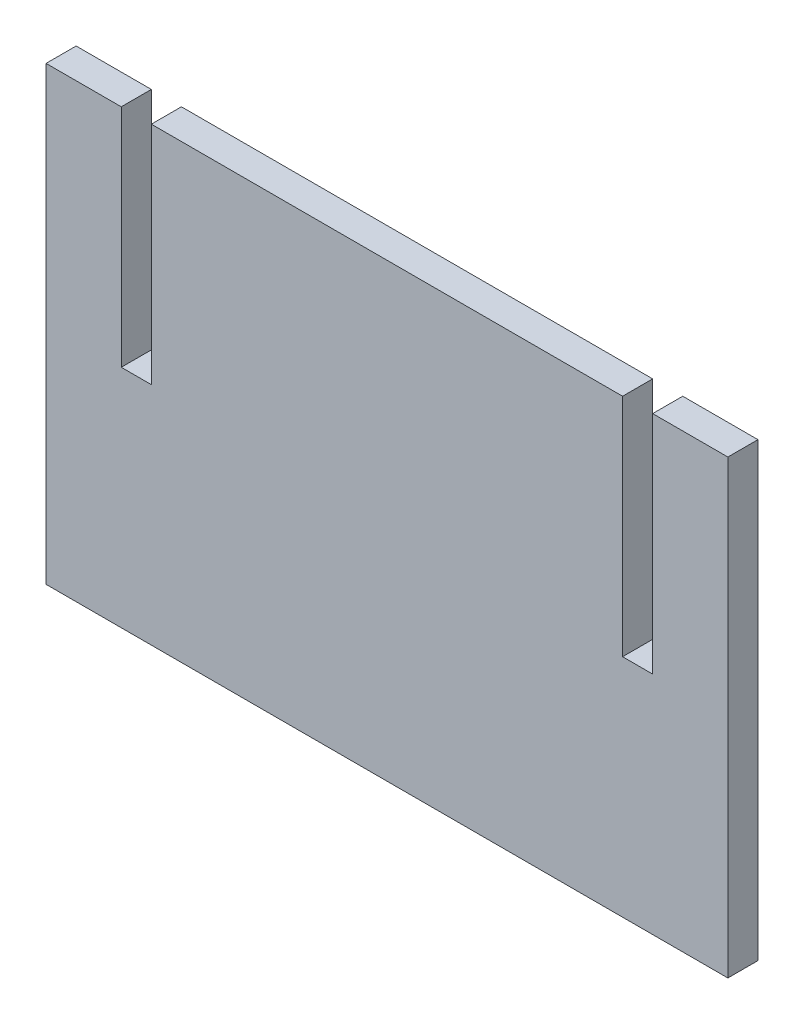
ISO-10303-21;
HEADER;
FILE_DESCRIPTION(('STEP AP214'),'2;1');
FILE_NAME('part.step','',(''),(''),'','','');
FILE_SCHEMA(('AUTOMOTIVE_DESIGN { 1 0 10303 214 1 1 1 1 }'));
ENDSEC;
DATA;
#1=APPLICATION_CONTEXT('core data for automotive mechanical design processes');
#2=APPLICATION_PROTOCOL_DEFINITION('international standard','automotive_design',2000,#1);
#3=PRODUCT_CONTEXT('',#1,'mechanical');
#4=PRODUCT('Part','Part','',(#3));
#5=PRODUCT_RELATED_PRODUCT_CATEGORY('part','',(#4));
#6=PRODUCT_DEFINITION_FORMATION('','',#4);
#7=PRODUCT_DEFINITION_CONTEXT('part definition',#1,'design');
#8=PRODUCT_DEFINITION('design','',#6,#7);
#9=PRODUCT_DEFINITION_SHAPE('','',#8);
#10=(LENGTH_UNIT() NAMED_UNIT(*) SI_UNIT(.MILLI.,.METRE.));
#11=(NAMED_UNIT(*) PLANE_ANGLE_UNIT() SI_UNIT($,.RADIAN.));
#12=(NAMED_UNIT(*) SI_UNIT($,.STERADIAN.) SOLID_ANGLE_UNIT());
#13=UNCERTAINTY_MEASURE_WITH_UNIT(LENGTH_MEASURE(1.E-05),#10,'distance_accuracy_value','');
#14=(GEOMETRIC_REPRESENTATION_CONTEXT(3) GLOBAL_UNCERTAINTY_ASSIGNED_CONTEXT((#13)) GLOBAL_UNIT_ASSIGNED_CONTEXT((#10,
#11,#12)) REPRESENTATION_CONTEXT('',''));
#15=CARTESIAN_POINT('',(0.,0.,0.));
#16=DIRECTION('',(0.,0.,1.));
#17=DIRECTION('',(1.,0.,0.));
#18=AXIS2_PLACEMENT_3D('',#15,#16,#17);
#19=CARTESIAN_POINT('',(0.,90.,12.));
#20=DIRECTION('',(0.,1.,0.));
#21=DIRECTION('',(-1.,0.,0.));
#22=AXIS2_PLACEMENT_3D('',#19,#20,#21);
#23=PLANE('',#22);
#24=DIRECTION('',(1.,0.,0.));
#25=VECTOR('',#24,1.);
#26=CARTESIAN_POINT('',(0.,90.,0.));
#27=LINE('',#26,#25);
#28=CARTESIAN_POINT('',(-94.,90.,0.));
#29=VERTEX_POINT('',#28);
#30=CARTESIAN_POINT('',(94.,90.,0.));
#31=VERTEX_POINT('',#30);
#32=EDGE_CURVE('E163',#29,#31,#27,.T.);
#33=ORIENTED_EDGE('',*,*,#32,.F.);
#34=DIRECTION('',(0.,0.,-1.));
#35=VECTOR('',#34,1.);
#36=CARTESIAN_POINT('',(-94.,90.,12.));
#37=LINE('',#36,#35);
#38=CARTESIAN_POINT('',(-94.,90.,12.));
#39=VERTEX_POINT('',#38);
#40=EDGE_CURVE('E11',#39,#29,#37,.T.);
#41=ORIENTED_EDGE('',*,*,#40,.F.);
#42=DIRECTION('',(1.,0.,0.));
#43=VECTOR('',#42,1.);
#44=CARTESIAN_POINT('',(0.,90.,12.));
#45=LINE('',#44,#43);
#46=CARTESIAN_POINT('',(94.,90.,12.));
#47=VERTEX_POINT('',#46);
#48=EDGE_CURVE('E190',#39,#47,#45,.T.);
#49=ORIENTED_EDGE('',*,*,#48,.T.);
#50=DIRECTION('',(0.,0.,-1.));
#51=VECTOR('',#50,1.);
#52=CARTESIAN_POINT('',(94.,90.,12.));
#53=LINE('',#52,#51);
#54=EDGE_CURVE('E62',#47,#31,#53,.T.);
#55=ORIENTED_EDGE('',*,*,#54,.T.);
#56=EDGE_LOOP('',(#33,#41,#49,#55));
#57=FACE_BOUND('',#56,.T.);
#58=ADVANCED_FACE('F45',(#57),#23,.T.);
#59=CARTESIAN_POINT('',(-94.,0.,12.));
#60=DIRECTION('',(1.,0.,0.));
#61=DIRECTION('',(0.,1.,0.));
#62=AXIS2_PLACEMENT_3D('',#59,#60,#61);
#63=PLANE('',#62);
#64=DIRECTION('',(0.,-1.,0.));
#65=VECTOR('',#64,1.);
#66=CARTESIAN_POINT('',(-94.,0.,0.));
#67=LINE('',#66,#65);
#68=CARTESIAN_POINT('',(-94.,0.,0.));
#69=VERTEX_POINT('',#68);
#70=EDGE_CURVE('E165',#29,#69,#67,.T.);
#71=ORIENTED_EDGE('',*,*,#70,.T.);
#72=DIRECTION('',(0.,0.,-1.));
#73=VECTOR('',#72,1.);
#74=CARTESIAN_POINT('',(-94.,0.,12.));
#75=LINE('',#74,#73);
#76=CARTESIAN_POINT('',(-94.,0.,12.));
#77=VERTEX_POINT('',#76);
#78=EDGE_CURVE('E54',#77,#69,#75,.T.);
#79=ORIENTED_EDGE('',*,*,#78,.F.);
#80=DIRECTION('',(0.,-1.,0.));
#81=VECTOR('',#80,1.);
#82=CARTESIAN_POINT('',(-94.,0.,12.));
#83=LINE('',#82,#81);
#84=EDGE_CURVE('E227',#39,#77,#83,.T.);
#85=ORIENTED_EDGE('',*,*,#84,.F.);
#86=ORIENTED_EDGE('',*,*,#40,.T.);
#87=EDGE_LOOP('',(#71,#79,#85,#86));
#88=FACE_BOUND('',#87,.T.);
#89=ADVANCED_FACE('F47',(#88),#63,.F.);
#90=CARTESIAN_POINT('',(0.,0.,12.));
#91=DIRECTION('',(0.,1.,0.));
#92=DIRECTION('',(-1.,0.,0.));
#93=AXIS2_PLACEMENT_3D('',#90,#91,#92);
#94=PLANE('',#93);
#95=DIRECTION('',(1.,0.,0.));
#96=VECTOR('',#95,1.);
#97=CARTESIAN_POINT('',(0.,0.,0.));
#98=LINE('',#97,#96);
#99=CARTESIAN_POINT('',(-106.,0.,0.));
#100=VERTEX_POINT('',#99);
#101=EDGE_CURVE('E170',#100,#69,#98,.T.);
#102=ORIENTED_EDGE('',*,*,#101,.F.);
#103=DIRECTION('',(0.,0.,-1.));
#104=VECTOR('',#103,1.);
#105=CARTESIAN_POINT('',(-106.,0.,12.));
#106=LINE('',#105,#104);
#107=CARTESIAN_POINT('',(-106.,0.,12.));
#108=VERTEX_POINT('',#107);
#109=EDGE_CURVE('E205',#108,#100,#106,.T.);
#110=ORIENTED_EDGE('',*,*,#109,.F.);
#111=DIRECTION('',(1.,0.,0.));
#112=VECTOR('',#111,1.);
#113=CARTESIAN_POINT('',(0.,0.,12.));
#114=LINE('',#113,#112);
#115=EDGE_CURVE('E212',#108,#77,#114,.T.);
#116=ORIENTED_EDGE('',*,*,#115,.T.);
#117=ORIENTED_EDGE('',*,*,#78,.T.);
#118=EDGE_LOOP('',(#102,#110,#116,#117));
#119=FACE_BOUND('',#118,.T.);
#120=ADVANCED_FACE('F210',(#119),#94,.T.);
#121=CARTESIAN_POINT('',(-106.,0.,12.));
#122=DIRECTION('',(1.,0.,0.));
#123=DIRECTION('',(0.,1.,0.));
#124=AXIS2_PLACEMENT_3D('',#121,#122,#123);
#125=PLANE('',#124);
#126=DIRECTION('',(0.,-1.,0.));
#127=VECTOR('',#126,1.);
#128=CARTESIAN_POINT('',(-106.,0.,0.));
#129=LINE('',#128,#127);
#130=CARTESIAN_POINT('',(-106.,90.,0.));
#131=VERTEX_POINT('',#130);
#132=EDGE_CURVE('E173',#131,#100,#129,.T.);
#133=ORIENTED_EDGE('',*,*,#132,.F.);
#134=DIRECTION('',(0.,0.,-1.));
#135=VECTOR('',#134,1.);
#136=CARTESIAN_POINT('',(-106.,90.,12.));
#137=LINE('',#136,#135);
#138=CARTESIAN_POINT('',(-106.,90.,12.));
#139=VERTEX_POINT('',#138);
#140=EDGE_CURVE('E203',#139,#131,#137,.T.);
#141=ORIENTED_EDGE('',*,*,#140,.F.);
#142=DIRECTION('',(0.,-1.,0.));
#143=VECTOR('',#142,1.);
#144=CARTESIAN_POINT('',(-106.,0.,12.));
#145=LINE('',#144,#143);
#146=EDGE_CURVE('E224',#139,#108,#145,.T.);
#147=ORIENTED_EDGE('',*,*,#146,.T.);
#148=ORIENTED_EDGE('',*,*,#109,.T.);
#149=EDGE_LOOP('',(#133,#141,#147,#148));
#150=FACE_BOUND('',#149,.T.);
#151=ADVANCED_FACE('F221',(#150),#125,.T.);
#152=CARTESIAN_POINT('',(-136.,90.,0.));
#153=VERTEX_POINT('',#152);
#154=EDGE_CURVE('E167',#153,#131,#27,.T.);
#155=ORIENTED_EDGE('',*,*,#154,.F.);
#156=DIRECTION('',(0.,0.,-1.));
#157=VECTOR('',#156,1.);
#158=CARTESIAN_POINT('',(-136.,90.,12.));
#159=LINE('',#158,#157);
#160=CARTESIAN_POINT('',(-136.,90.,12.));
#161=VERTEX_POINT('',#160);
#162=EDGE_CURVE('E201',#161,#153,#159,.T.);
#163=ORIENTED_EDGE('',*,*,#162,.F.);
#164=EDGE_CURVE('E229',#161,#139,#45,.T.);
#165=ORIENTED_EDGE('',*,*,#164,.T.);
#166=ORIENTED_EDGE('',*,*,#140,.T.);
#167=EDGE_LOOP('',(#155,#163,#165,#166));
#168=FACE_BOUND('',#167,.T.);
#169=ADVANCED_FACE('F254',(#168),#23,.T.);
#170=CARTESIAN_POINT('',(-136.,0.,12.));
#171=DIRECTION('',(-1.,0.,0.));
#172=DIRECTION('',(0.,0.,1.));
#173=AXIS2_PLACEMENT_3D('',#170,#171,#172);
#174=PLANE('',#173);
#175=DIRECTION('',(0.,1.,0.));
#176=VECTOR('',#175,1.);
#177=CARTESIAN_POINT('',(-136.,0.,0.));
#178=LINE('',#177,#176);
#179=CARTESIAN_POINT('',(-136.,-90.,0.));
#180=VERTEX_POINT('',#179);
#181=EDGE_CURVE('E176',#180,#153,#178,.T.);
#182=ORIENTED_EDGE('',*,*,#181,.F.);
#183=DIRECTION('',(0.,0.,-1.));
#184=VECTOR('',#183,1.);
#185=CARTESIAN_POINT('',(-136.,-90.,12.));
#186=LINE('',#185,#184);
#187=CARTESIAN_POINT('',(-136.,-90.,12.));
#188=VERTEX_POINT('',#187);
#189=EDGE_CURVE('E199',#188,#180,#186,.T.);
#190=ORIENTED_EDGE('',*,*,#189,.F.);
#191=DIRECTION('',(0.,1.,0.));
#192=VECTOR('',#191,1.);
#193=CARTESIAN_POINT('',(-136.,0.,12.));
#194=LINE('',#193,#192);
#195=EDGE_CURVE('E234',#188,#161,#194,.T.);
#196=ORIENTED_EDGE('',*,*,#195,.T.);
#197=ORIENTED_EDGE('',*,*,#162,.T.);
#198=EDGE_LOOP('',(#182,#190,#196,#197));
#199=FACE_BOUND('',#198,.T.);
#200=ADVANCED_FACE('F262',(#199),#174,.T.);
#201=CARTESIAN_POINT('',(0.,-90.,12.));
#202=DIRECTION('',(0.,1.,0.));
#203=DIRECTION('',(-1.,0.,0.));
#204=AXIS2_PLACEMENT_3D('',#201,#202,#203);
#205=PLANE('',#204);
#206=DIRECTION('',(1.,0.,0.));
#207=VECTOR('',#206,1.);
#208=CARTESIAN_POINT('',(0.,-90.,0.));
#209=LINE('',#208,#207);
#210=CARTESIAN_POINT('',(136.,-90.,0.));
#211=VERTEX_POINT('',#210);
#212=EDGE_CURVE('E179',#180,#211,#209,.T.);
#213=ORIENTED_EDGE('',*,*,#212,.T.);
#214=DIRECTION('',(0.,0.,-1.));
#215=VECTOR('',#214,1.);
#216=CARTESIAN_POINT('',(136.,-90.,12.));
#217=LINE('',#216,#215);
#218=CARTESIAN_POINT('',(136.,-90.,12.));
#219=VERTEX_POINT('',#218);
#220=EDGE_CURVE('E196',#219,#211,#217,.T.);
#221=ORIENTED_EDGE('',*,*,#220,.F.);
#222=DIRECTION('',(1.,0.,0.));
#223=VECTOR('',#222,1.);
#224=CARTESIAN_POINT('',(0.,-90.,12.));
#225=LINE('',#224,#223);
#226=EDGE_CURVE('E237',#188,#219,#225,.T.);
#227=ORIENTED_EDGE('',*,*,#226,.F.);
#228=ORIENTED_EDGE('',*,*,#189,.T.);
#229=EDGE_LOOP('',(#213,#221,#227,#228));
#230=FACE_BOUND('',#229,.T.);
#231=ADVANCED_FACE('F270',(#230),#205,.F.);
#232=CARTESIAN_POINT('',(136.,0.,12.));
#233=DIRECTION('',(-1.,0.,0.));
#234=DIRECTION('',(0.,0.,1.));
#235=AXIS2_PLACEMENT_3D('',#232,#233,#234);
#236=PLANE('',#235);
#237=DIRECTION('',(0.,1.,0.));
#238=VECTOR('',#237,1.);
#239=CARTESIAN_POINT('',(136.,0.,0.));
#240=LINE('',#239,#238);
#241=CARTESIAN_POINT('',(136.,90.,0.));
#242=VERTEX_POINT('',#241);
#243=EDGE_CURVE('E181',#211,#242,#240,.T.);
#244=ORIENTED_EDGE('',*,*,#243,.T.);
#245=DIRECTION('',(0.,0.,-1.));
#246=VECTOR('',#245,1.);
#247=CARTESIAN_POINT('',(136.,90.,12.));
#248=LINE('',#247,#246);
#249=CARTESIAN_POINT('',(136.,90.,12.));
#250=VERTEX_POINT('',#249);
#251=EDGE_CURVE('E194',#250,#242,#248,.T.);
#252=ORIENTED_EDGE('',*,*,#251,.F.);
#253=DIRECTION('',(0.,1.,0.));
#254=VECTOR('',#253,1.);
#255=CARTESIAN_POINT('',(136.,0.,12.));
#256=LINE('',#255,#254);
#257=EDGE_CURVE('E238',#219,#250,#256,.T.);
#258=ORIENTED_EDGE('',*,*,#257,.F.);
#259=ORIENTED_EDGE('',*,*,#220,.T.);
#260=EDGE_LOOP('',(#244,#252,#258,#259));
#261=FACE_BOUND('',#260,.T.);
#262=ADVANCED_FACE('F265',(#261),#236,.F.);
#263=CARTESIAN_POINT('',(106.,90.,0.));
#264=VERTEX_POINT('',#263);
#265=EDGE_CURVE('E166',#264,#242,#27,.T.);
#266=ORIENTED_EDGE('',*,*,#265,.F.);
#267=DIRECTION('',(0.,0.,-1.));
#268=VECTOR('',#267,1.);
#269=CARTESIAN_POINT('',(106.,90.,12.));
#270=LINE('',#269,#268);
#271=CARTESIAN_POINT('',(106.,90.,12.));
#272=VERTEX_POINT('',#271);
#273=EDGE_CURVE('E155',#272,#264,#270,.T.);
#274=ORIENTED_EDGE('',*,*,#273,.F.);
#275=EDGE_CURVE('E145',#272,#250,#45,.T.);
#276=ORIENTED_EDGE('',*,*,#275,.T.);
#277=ORIENTED_EDGE('',*,*,#251,.T.);
#278=EDGE_LOOP('',(#266,#274,#276,#277));
#279=FACE_BOUND('',#278,.T.);
#280=ADVANCED_FACE('F255',(#279),#23,.T.);
#281=CARTESIAN_POINT('',(106.,0.,12.));
#282=DIRECTION('',(1.,0.,0.));
#283=DIRECTION('',(0.,1.,0.));
#284=AXIS2_PLACEMENT_3D('',#281,#282,#283);
#285=PLANE('',#284);
#286=DIRECTION('',(0.,-1.,0.));
#287=VECTOR('',#286,1.);
#288=CARTESIAN_POINT('',(106.,0.,0.));
#289=LINE('',#288,#287);
#290=CARTESIAN_POINT('',(106.,0.,0.));
#291=VERTEX_POINT('',#290);
#292=EDGE_CURVE('E152',#264,#291,#289,.T.);
#293=ORIENTED_EDGE('',*,*,#292,.T.);
#294=DIRECTION('',(0.,0.,-1.));
#295=VECTOR('',#294,1.);
#296=CARTESIAN_POINT('',(106.,0.,12.));
#297=LINE('',#296,#295);
#298=CARTESIAN_POINT('',(106.,0.,12.));
#299=VERTEX_POINT('',#298);
#300=EDGE_CURVE('E149',#299,#291,#297,.T.);
#301=ORIENTED_EDGE('',*,*,#300,.F.);
#302=DIRECTION('',(0.,-1.,0.));
#303=VECTOR('',#302,1.);
#304=CARTESIAN_POINT('',(106.,0.,12.));
#305=LINE('',#304,#303);
#306=EDGE_CURVE('E137',#272,#299,#305,.T.);
#307=ORIENTED_EDGE('',*,*,#306,.F.);
#308=ORIENTED_EDGE('',*,*,#273,.T.);
#309=EDGE_LOOP('',(#293,#301,#307,#308));
#310=FACE_BOUND('',#309,.T.);
#311=ADVANCED_FACE('F150',(#310),#285,.F.);
#312=CARTESIAN_POINT('',(0.,0.,12.));
#313=DIRECTION('',(0.,1.,0.));
#314=DIRECTION('',(-1.,0.,0.));
#315=AXIS2_PLACEMENT_3D('',#312,#313,#314);
#316=PLANE('',#315);
#317=DIRECTION('',(1.,0.,0.));
#318=VECTOR('',#317,1.);
#319=CARTESIAN_POINT('',(0.,0.,0.));
#320=LINE('',#319,#318);
#321=CARTESIAN_POINT('',(94.,0.,0.));
#322=VERTEX_POINT('',#321);
#323=EDGE_CURVE('E185',#322,#291,#320,.T.);
#324=ORIENTED_EDGE('',*,*,#323,.F.);
#325=DIRECTION('',(0.,0.,-1.));
#326=VECTOR('',#325,1.);
#327=CARTESIAN_POINT('',(94.,0.,12.));
#328=LINE('',#327,#326);
#329=CARTESIAN_POINT('',(94.,0.,12.));
#330=VERTEX_POINT('',#329);
#331=EDGE_CURVE('E99',#330,#322,#328,.T.);
#332=ORIENTED_EDGE('',*,*,#331,.F.);
#333=DIRECTION('',(1.,0.,0.));
#334=VECTOR('',#333,1.);
#335=CARTESIAN_POINT('',(0.,0.,12.));
#336=LINE('',#335,#334);
#337=EDGE_CURVE('E143',#330,#299,#336,.T.);
#338=ORIENTED_EDGE('',*,*,#337,.T.);
#339=ORIENTED_EDGE('',*,*,#300,.T.);
#340=EDGE_LOOP('',(#324,#332,#338,#339));
#341=FACE_BOUND('',#340,.T.);
#342=ADVANCED_FACE('F157',(#341),#316,.T.);
#343=CARTESIAN_POINT('',(94.,0.,12.));
#344=DIRECTION('',(1.,0.,0.));
#345=DIRECTION('',(0.,1.,0.));
#346=AXIS2_PLACEMENT_3D('',#343,#344,#345);
#347=PLANE('',#346);
#348=DIRECTION('',(0.,-1.,0.));
#349=VECTOR('',#348,1.);
#350=CARTESIAN_POINT('',(94.,0.,0.));
#351=LINE('',#350,#349);
#352=EDGE_CURVE('E187',#31,#322,#351,.T.);
#353=ORIENTED_EDGE('',*,*,#352,.F.);
#354=ORIENTED_EDGE('',*,*,#54,.F.);
#355=DIRECTION('',(0.,-1.,0.));
#356=VECTOR('',#355,1.);
#357=CARTESIAN_POINT('',(94.,0.,12.));
#358=LINE('',#357,#356);
#359=EDGE_CURVE('E158',#47,#330,#358,.T.);
#360=ORIENTED_EDGE('',*,*,#359,.T.);
#361=ORIENTED_EDGE('',*,*,#331,.T.);
#362=EDGE_LOOP('',(#353,#354,#360,#361));
#363=FACE_BOUND('',#362,.T.);
#364=ADVANCED_FACE('F242',(#363),#347,.T.);
#365=CARTESIAN_POINT('',(0.,0.,12.));
#366=DIRECTION('',(0.,0.,1.));
#367=DIRECTION('',(1.,0.,0.));
#368=AXIS2_PLACEMENT_3D('',#365,#366,#367);
#369=PLANE('',#368);
#370=ORIENTED_EDGE('',*,*,#48,.F.);
#371=ORIENTED_EDGE('',*,*,#84,.T.);
#372=ORIENTED_EDGE('',*,*,#115,.F.);
#373=ORIENTED_EDGE('',*,*,#146,.F.);
#374=ORIENTED_EDGE('',*,*,#164,.F.);
#375=ORIENTED_EDGE('',*,*,#195,.F.);
#376=ORIENTED_EDGE('',*,*,#226,.T.);
#377=ORIENTED_EDGE('',*,*,#257,.T.);
#378=ORIENTED_EDGE('',*,*,#275,.F.);
#379=ORIENTED_EDGE('',*,*,#306,.T.);
#380=ORIENTED_EDGE('',*,*,#337,.F.);
#381=ORIENTED_EDGE('',*,*,#359,.F.);
#382=EDGE_LOOP('',(#370,#371,#372,#373,#374,#375,#376,#377,#378,#379,#380,#381));
#383=FACE_BOUND('',#382,.T.);
#384=ADVANCED_FACE('F140',(#383),#369,.T.);
#385=CARTESIAN_POINT('',(0.,0.,0.));
#386=DIRECTION('',(0.,0.,1.));
#387=DIRECTION('',(1.,0.,0.));
#388=AXIS2_PLACEMENT_3D('',#385,#386,#387);
#389=PLANE('',#388);
#390=ORIENTED_EDGE('',*,*,#32,.T.);
#391=ORIENTED_EDGE('',*,*,#352,.T.);
#392=ORIENTED_EDGE('',*,*,#323,.T.);
#393=ORIENTED_EDGE('',*,*,#292,.F.);
#394=ORIENTED_EDGE('',*,*,#265,.T.);
#395=ORIENTED_EDGE('',*,*,#243,.F.);
#396=ORIENTED_EDGE('',*,*,#212,.F.);
#397=ORIENTED_EDGE('',*,*,#181,.T.);
#398=ORIENTED_EDGE('',*,*,#154,.T.);
#399=ORIENTED_EDGE('',*,*,#132,.T.);
#400=ORIENTED_EDGE('',*,*,#101,.T.);
#401=ORIENTED_EDGE('',*,*,#70,.F.);
#402=EDGE_LOOP('',(#390,#391,#392,#393,#394,#395,#396,#397,#398,#399,#400,#401));
#403=FACE_BOUND('',#402,.T.);
#404=ADVANCED_FACE('F216',(#403),#389,.F.);
#405=CLOSED_SHELL('',(#58,#89,#120,#151,#169,#200,#231,#262,#280,#311,#342,#364,#384,#404));
#406=MANIFOLD_SOLID_BREP('B2',#405);
#407=ADVANCED_BREP_SHAPE_REPRESENTATION('',(#18,#406),#14);
#408=SHAPE_DEFINITION_REPRESENTATION(#9,#407);
ENDSEC;
END-ISO-10303-21;
